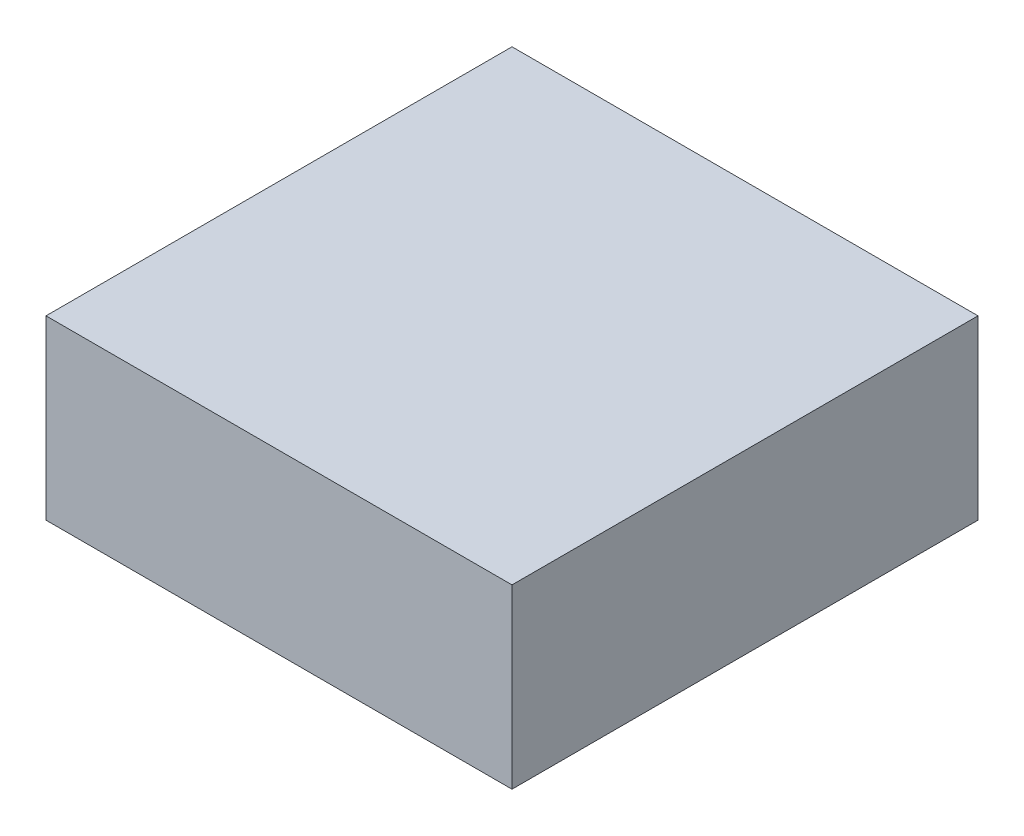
from build123d import *

# Parameters (mm, degrees)
SKETCH1_W           = 15.8
SKETCH1_H           = 15.8
BOSS_EXTRUDE1_DEPTH = 6


with BuildPart() as part:
    # Sketch1 → Boss-Extrude1 (new body)
    with BuildSketch(Plane(origin=(0, 0, 0), x_dir=(1, 0, 0), z_dir=(0, 1, 0))):
        Rectangle(SKETCH1_W, SKETCH1_H)
    extrude(amount=BOSS_EXTRUDE1_DEPTH)


solid = part.part
